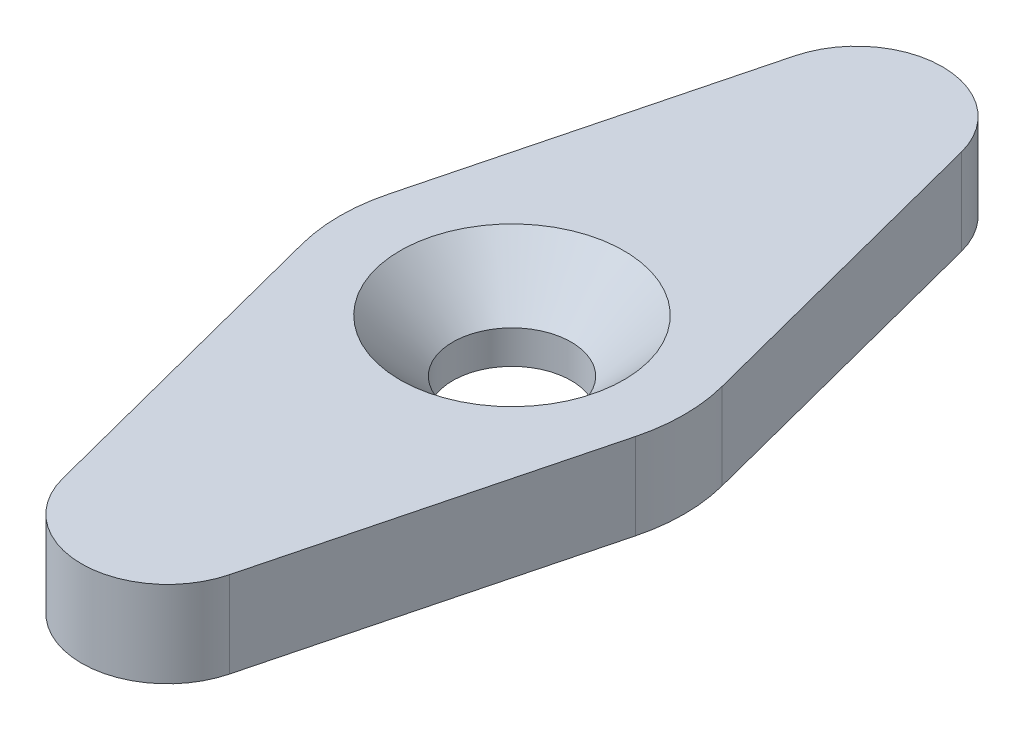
from build123d import *

# Parameters (mm, degrees)
EXTRUDE1_DEPTH = 4


with BuildPart() as part:
    # Sketch1 → Extrude1 (new body)
    with BuildSketch(Plane(origin=(0, 0, 0), x_dir=(1, 0, 0), z_dir=(0, 1, 0))):
        with BuildLine():
            Line((3.872983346, -17), (7.745966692, -2))
            ThreePointArc((7.745966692, -2), (8, 0), (7.745966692, 2))
            Line((7.745966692, 2), (3.872983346, 17))
            ThreePointArc((3.872983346, 17), (0, 20), (-3.872983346, 17))
            Line((-3.872983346, 17), (-7.745966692, 2))
            ThreePointArc((-7.745966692, 2), (-8, 0), (-7.745966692, -2))
            Line((-7.745966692, -2), (-3.872983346, -17))
            ThreePointArc((-3.872983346, -17), (0, -20), (3.872983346, -17))
        make_face()
    extrude(amount=EXTRUDE1_DEPTH)

    # Sketch3 → CSK for M5 Countersunk Flat Head Screw1 (revolve, cut)
    with BuildSketch(Plane(origin=(0, 4, 0), x_dir=(0, 0, 1), z_dir=(1, 0, 0))):
        Polygon((0, 0), (0, 4), (2.75, 4), (2.75, 2.45), (5.2, 0), align=None)
    revolve(axis=Axis((0, 10.35, 0), (0, -1, 0)), mode=Mode.SUBTRACT)


solid = part.part
